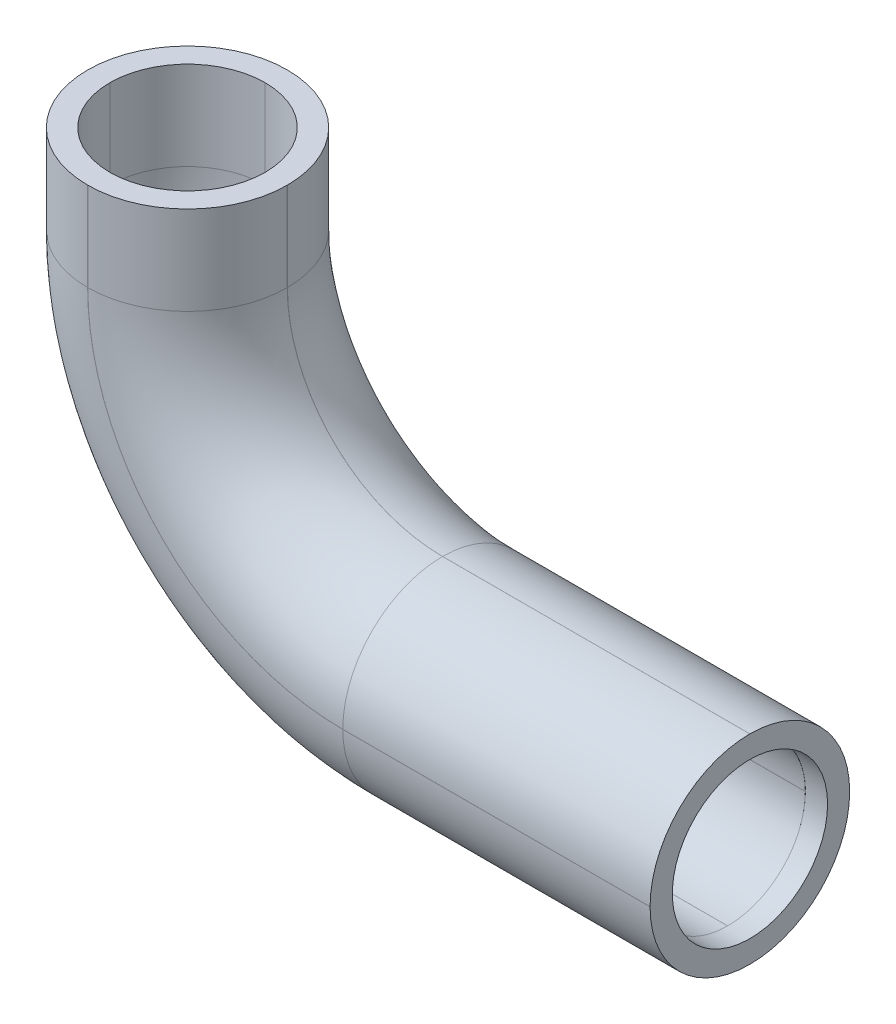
ISO-10303-21;
HEADER;
FILE_DESCRIPTION(('STEP AP214'),'2;1');
FILE_NAME('part.step','',(''),(''),'','','');
FILE_SCHEMA(('AUTOMOTIVE_DESIGN { 1 0 10303 214 1 1 1 1 }'));
ENDSEC;
DATA;
#1=APPLICATION_CONTEXT('core data for automotive mechanical design processes');
#2=APPLICATION_PROTOCOL_DEFINITION('international standard','automotive_design',2000,#1);
#3=PRODUCT_CONTEXT('',#1,'mechanical');
#4=PRODUCT('Part','Part','',(#3));
#5=PRODUCT_RELATED_PRODUCT_CATEGORY('part','',(#4));
#6=PRODUCT_DEFINITION_FORMATION('','',#4);
#7=PRODUCT_DEFINITION_CONTEXT('part definition',#1,'design');
#8=PRODUCT_DEFINITION('design','',#6,#7);
#9=PRODUCT_DEFINITION_SHAPE('','',#8);
#10=(LENGTH_UNIT() NAMED_UNIT(*) SI_UNIT(.MILLI.,.METRE.));
#11=(NAMED_UNIT(*) PLANE_ANGLE_UNIT() SI_UNIT($,.RADIAN.));
#12=(NAMED_UNIT(*) SI_UNIT($,.STERADIAN.) SOLID_ANGLE_UNIT());
#13=UNCERTAINTY_MEASURE_WITH_UNIT(LENGTH_MEASURE(1.E-05),#10,'distance_accuracy_value','');
#14=(GEOMETRIC_REPRESENTATION_CONTEXT(3) GLOBAL_UNCERTAINTY_ASSIGNED_CONTEXT((#13)) GLOBAL_UNIT_ASSIGNED_CONTEXT((#10,
#11,#12)) REPRESENTATION_CONTEXT('',''));
#15=CARTESIAN_POINT('',(0.,0.,0.));
#16=DIRECTION('',(0.,0.,1.));
#17=DIRECTION('',(1.,0.,0.));
#18=AXIS2_PLACEMENT_3D('',#15,#16,#17);
#19=CARTESIAN_POINT('',(0.,0.,-28.575));
#20=DIRECTION('',(-1.,0.,0.));
#21=DIRECTION('',(0.,0.,1.));
#22=AXIS2_PLACEMENT_3D('',#19,#20,#21);
#23=PLANE('',#22);
#24=DIRECTION('',(0.,0.,1.));
#25=VECTOR('',#24,1.);
#26=CARTESIAN_POINT('',(0.,63.5,-28.575));
#27=LINE('',#26,#25);
#28=CARTESIAN_POINT('',(0.,63.5,-14.3002));
#29=VERTEX_POINT('',#28);
#30=CARTESIAN_POINT('',(0.,63.5,-14.2748));
#31=VERTEX_POINT('',#30);
#32=EDGE_CURVE('E397',#29,#31,#27,.T.);
#33=ORIENTED_EDGE('',*,*,#32,.F.);
#34=DIRECTION('',(0.,-1.,0.));
#35=VECTOR('',#34,1.);
#36=CARTESIAN_POINT('',(0.,0.,-14.3002));
#37=LINE('',#36,#35);
#38=CARTESIAN_POINT('',(0.,50.8,-14.3002));
#39=VERTEX_POINT('',#38);
#40=EDGE_CURVE('E447',#29,#39,#37,.T.);
#41=ORIENTED_EDGE('',*,*,#40,.T.);
#42=DIRECTION('',(0.,0.,1.));
#43=VECTOR('',#42,1.);
#44=CARTESIAN_POINT('',(0.,50.8,-28.575));
#45=LINE('',#44,#43);
#46=CARTESIAN_POINT('',(0.,50.8,-14.2748));
#47=VERTEX_POINT('',#46);
#48=EDGE_CURVE('E414',#39,#47,#45,.T.);
#49=ORIENTED_EDGE('',*,*,#48,.T.);
#50=DIRECTION('',(0.,-1.,0.));
#51=VECTOR('',#50,1.);
#52=CARTESIAN_POINT('',(0.,63.5,-14.2748));
#53=LINE('',#52,#51);
#54=EDGE_CURVE('E445',#47,#31,#53,.F.);
#55=ORIENTED_EDGE('',*,*,#54,.T.);
#56=EDGE_LOOP('',(#33,#41,#49,#55));
#57=FACE_BOUND('',#56,.T.);
#58=ADVANCED_FACE('F35',(#57),#23,.T.);
#59=CARTESIAN_POINT('',(0.,63.5,-28.575));
#60=DIRECTION('',(0.,1.,0.));
#61=DIRECTION('',(0.,0.,1.));
#62=AXIS2_PLACEMENT_3D('',#59,#60,#61);
#63=PLANE('',#62);
#64=DIRECTION('',(-1.,0.,0.));
#65=VECTOR('',#64,1.);
#66=CARTESIAN_POINT('',(0.,63.5,-25.4));
#67=LINE('',#66,#65);
#68=CARTESIAN_POINT('',(14.3002,63.5,-25.4));
#69=VERTEX_POINT('',#68);
#70=CARTESIAN_POINT('',(14.2748,63.5,-25.4));
#71=VERTEX_POINT('',#70);
#72=EDGE_CURVE('E378',#69,#71,#67,.T.);
#73=ORIENTED_EDGE('',*,*,#72,.F.);
#74=CARTESIAN_POINT('',(14.3002,63.5,-14.3002));
#75=DIRECTION('',(0.,1.,0.));
#76=DIRECTION('',(0.,0.,1.));
#77=AXIS2_PLACEMENT_3D('',#74,#75,#76);
#78=CIRCLE('',#77,11.0998);
#79=CARTESIAN_POINT('',(25.4,63.5,-14.3002));
#80=VERTEX_POINT('',#79);
#81=EDGE_CURVE('E369',#80,#69,#78,.T.);
#82=ORIENTED_EDGE('',*,*,#81,.F.);
#83=DIRECTION('',(0.,0.,1.));
#84=VECTOR('',#83,1.);
#85=CARTESIAN_POINT('',(25.4,63.5,-28.575));
#86=LINE('',#85,#84);
#87=CARTESIAN_POINT('',(25.4,63.5,-14.2748));
#88=VERTEX_POINT('',#87);
#89=EDGE_CURVE('E59',#80,#88,#86,.T.);
#90=ORIENTED_EDGE('',*,*,#89,.T.);
#91=CARTESIAN_POINT('',(14.3002,63.5,-14.2748));
#92=DIRECTION('',(0.,1.,0.));
#93=DIRECTION('',(0.,0.,1.));
#94=AXIS2_PLACEMENT_3D('',#91,#92,#93);
#95=CIRCLE('',#94,11.0998);
#96=CARTESIAN_POINT('',(14.3002,63.5,-3.175));
#97=VERTEX_POINT('',#96);
#98=EDGE_CURVE('E373',#97,#88,#95,.T.);
#99=ORIENTED_EDGE('',*,*,#98,.F.);
#100=DIRECTION('',(-1.,0.,0.));
#101=VECTOR('',#100,1.);
#102=CARTESIAN_POINT('',(0.,63.5,-3.175));
#103=LINE('',#102,#101);
#104=CARTESIAN_POINT('',(14.2748,63.5,-3.175));
#105=VERTEX_POINT('',#104);
#106=EDGE_CURVE('E291',#97,#105,#103,.T.);
#107=ORIENTED_EDGE('',*,*,#106,.T.);
#108=CARTESIAN_POINT('',(14.2748,63.5,-14.2748));
#109=DIRECTION('',(0.,1.,0.));
#110=DIRECTION('',(0.,0.,1.));
#111=AXIS2_PLACEMENT_3D('',#108,#109,#110);
#112=CIRCLE('',#111,11.0998);
#113=CARTESIAN_POINT('',(3.175,63.5,-14.2748));
#114=VERTEX_POINT('',#113);
#115=EDGE_CURVE('E367',#114,#105,#112,.T.);
#116=ORIENTED_EDGE('',*,*,#115,.F.);
#117=DIRECTION('',(0.,0.,1.));
#118=VECTOR('',#117,1.);
#119=CARTESIAN_POINT('',(3.175,63.5,-28.575));
#120=LINE('',#119,#118);
#121=CARTESIAN_POINT('',(3.175,63.5,-14.3002));
#122=VERTEX_POINT('',#121);
#123=EDGE_CURVE('E301',#122,#114,#120,.T.);
#124=ORIENTED_EDGE('',*,*,#123,.F.);
#125=CARTESIAN_POINT('',(14.2748,63.5,-14.3002));
#126=DIRECTION('',(0.,1.,0.));
#127=DIRECTION('',(0.,0.,1.));
#128=AXIS2_PLACEMENT_3D('',#125,#126,#127);
#129=CIRCLE('',#128,11.0998);
#130=EDGE_CURVE('E360',#71,#122,#129,.T.);
#131=ORIENTED_EDGE('',*,*,#130,.F.);
#132=EDGE_LOOP('',(#73,#82,#90,#99,#107,#116,#124,#131));
#133=FACE_BOUND('',#132,.T.);
#134=DIRECTION('',(-1.,0.,0.));
#135=VECTOR('',#134,1.);
#136=CARTESIAN_POINT('',(0.,63.5,-28.575));
#137=LINE('',#136,#135);
#138=CARTESIAN_POINT('',(14.3002,63.5,-28.575));
#139=VERTEX_POINT('',#138);
#140=CARTESIAN_POINT('',(14.2748,63.5,-28.575));
#141=VERTEX_POINT('',#140);
#142=EDGE_CURVE('E386',#139,#141,#137,.T.);
#143=ORIENTED_EDGE('',*,*,#142,.T.);
#144=CARTESIAN_POINT('',(14.2748,63.5,-14.3002));
#145=DIRECTION('',(0.,1.,0.));
#146=DIRECTION('',(0.,0.,1.));
#147=AXIS2_PLACEMENT_3D('',#144,#145,#146);
#148=CIRCLE('',#147,14.2748);
#149=EDGE_CURVE('E455',#141,#29,#148,.T.);
#150=ORIENTED_EDGE('',*,*,#149,.T.);
#151=ORIENTED_EDGE('',*,*,#32,.T.);
#152=CARTESIAN_POINT('',(14.2748,63.5,-14.2748));
#153=DIRECTION('',(0.,1.,0.));
#154=DIRECTION('',(0.,0.,1.));
#155=AXIS2_PLACEMENT_3D('',#152,#153,#154);
#156=CIRCLE('',#155,14.2748);
#157=CARTESIAN_POINT('',(14.2748,63.5,0.));
#158=VERTEX_POINT('',#157);
#159=EDGE_CURVE('E453',#31,#158,#156,.T.);
#160=ORIENTED_EDGE('',*,*,#159,.T.);
#161=DIRECTION('',(-1.,0.,0.));
#162=VECTOR('',#161,1.);
#163=CARTESIAN_POINT('',(0.,63.5,0.));
#164=LINE('',#163,#162);
#165=CARTESIAN_POINT('',(14.3002,63.5,0.));
#166=VERTEX_POINT('',#165);
#167=EDGE_CURVE('E387',#166,#158,#164,.T.);
#168=ORIENTED_EDGE('',*,*,#167,.F.);
#169=CARTESIAN_POINT('',(14.3002,63.5,-14.2748));
#170=DIRECTION('',(0.,1.,0.));
#171=DIRECTION('',(0.,0.,1.));
#172=AXIS2_PLACEMENT_3D('',#169,#170,#171);
#173=CIRCLE('',#172,14.2748);
#174=CARTESIAN_POINT('',(28.575,63.5,-14.2748));
#175=VERTEX_POINT('',#174);
#176=EDGE_CURVE('E449',#166,#175,#173,.T.);
#177=ORIENTED_EDGE('',*,*,#176,.T.);
#178=DIRECTION('',(0.,0.,1.));
#179=VECTOR('',#178,1.);
#180=CARTESIAN_POINT('',(28.575,63.5,-28.575));
#181=LINE('',#180,#179);
#182=CARTESIAN_POINT('',(28.575,63.5,-14.3002));
#183=VERTEX_POINT('',#182);
#184=EDGE_CURVE('E401',#183,#175,#181,.T.);
#185=ORIENTED_EDGE('',*,*,#184,.F.);
#186=CARTESIAN_POINT('',(14.3002,63.5,-14.3002));
#187=DIRECTION('',(0.,1.,0.));
#188=DIRECTION('',(0.,0.,1.));
#189=AXIS2_PLACEMENT_3D('',#186,#187,#188);
#190=CIRCLE('',#189,14.2748);
#191=EDGE_CURVE('E451',#183,#139,#190,.T.);
#192=ORIENTED_EDGE('',*,*,#191,.T.);
#193=EDGE_LOOP('',(#143,#150,#151,#160,#168,#177,#185,#192));
#194=FACE_BOUND('',#193,.T.);
#195=ADVANCED_FACE('F519',(#133,#194),#63,.T.);
#196=CARTESIAN_POINT('',(28.575,63.5,-28.575));
#197=DIRECTION('',(1.,0.,0.));
#198=DIRECTION('',(0.,0.,-1.));
#199=AXIS2_PLACEMENT_3D('',#196,#197,#198);
#200=PLANE('',#199);
#201=DIRECTION('',(0.,0.,1.));
#202=VECTOR('',#201,1.);
#203=CARTESIAN_POINT('',(28.575,50.8,-28.575));
#204=LINE('',#203,#202);
#205=CARTESIAN_POINT('',(28.575,50.8,-14.2748));
#206=VERTEX_POINT('',#205);
#207=CARTESIAN_POINT('',(28.575,50.8,-14.3002));
#208=VERTEX_POINT('',#207);
#209=EDGE_CURVE('E411',#206,#208,#204,.F.);
#210=ORIENTED_EDGE('',*,*,#209,.T.);
#211=DIRECTION('',(0.,1.,0.));
#212=VECTOR('',#211,1.);
#213=CARTESIAN_POINT('',(28.575,63.5,-14.3002));
#214=LINE('',#213,#212);
#215=EDGE_CURVE('E473',#208,#183,#214,.T.);
#216=ORIENTED_EDGE('',*,*,#215,.T.);
#217=ORIENTED_EDGE('',*,*,#184,.T.);
#218=DIRECTION('',(0.,1.,0.));
#219=VECTOR('',#218,1.);
#220=CARTESIAN_POINT('',(28.575,50.8,-14.2748));
#221=LINE('',#220,#219);
#222=EDGE_CURVE('E471',#175,#206,#221,.F.);
#223=ORIENTED_EDGE('',*,*,#222,.T.);
#224=EDGE_LOOP('',(#210,#216,#217,#223));
#225=FACE_BOUND('',#224,.T.);
#226=ADVANCED_FACE('F579',(#225),#200,.T.);
#227=CARTESIAN_POINT('',(28.575,28.575,-28.575));
#228=DIRECTION('',(0.,1.,0.));
#229=DIRECTION('',(0.,0.,1.));
#230=AXIS2_PLACEMENT_3D('',#227,#228,#229);
#231=PLANE('',#230);
#232=DIRECTION('',(0.,0.,1.));
#233=VECTOR('',#232,1.);
#234=CARTESIAN_POINT('',(94.7928,28.575,-28.575));
#235=LINE('',#234,#233);
#236=CARTESIAN_POINT('',(94.7928,28.575,-14.3002));
#237=VERTEX_POINT('',#236);
#238=CARTESIAN_POINT('',(94.7928,28.575,-14.2748));
#239=VERTEX_POINT('',#238);
#240=EDGE_CURVE('E404',#237,#239,#235,.T.);
#241=ORIENTED_EDGE('',*,*,#240,.F.);
#242=DIRECTION('',(-1.,0.,0.));
#243=VECTOR('',#242,1.);
#244=CARTESIAN_POINT('',(28.575,28.575,-14.3002));
#245=LINE('',#244,#243);
#246=CARTESIAN_POINT('',(50.8,28.575,-14.3002));
#247=VERTEX_POINT('',#246);
#248=EDGE_CURVE('E478',#237,#247,#245,.T.);
#249=ORIENTED_EDGE('',*,*,#248,.T.);
#250=DIRECTION('',(0.,0.,1.));
#251=VECTOR('',#250,1.);
#252=CARTESIAN_POINT('',(50.8,28.575,0.));
#253=LINE('',#252,#251);
#254=CARTESIAN_POINT('',(50.8,28.575,-14.2748));
#255=VERTEX_POINT('',#254);
#256=EDGE_CURVE('E400',#247,#255,#253,.T.);
#257=ORIENTED_EDGE('',*,*,#256,.T.);
#258=DIRECTION('',(-1.,0.,0.));
#259=VECTOR('',#258,1.);
#260=CARTESIAN_POINT('',(94.7928,28.575,-14.2748));
#261=LINE('',#260,#259);
#262=EDGE_CURVE('E476',#255,#239,#261,.F.);
#263=ORIENTED_EDGE('',*,*,#262,.T.);
#264=EDGE_LOOP('',(#241,#249,#257,#263));
#265=FACE_BOUND('',#264,.T.);
#266=ADVANCED_FACE('F565',(#265),#231,.T.);
#267=CARTESIAN_POINT('',(94.7928,0.,-28.575));
#268=DIRECTION('',(1.,0.,0.));
#269=DIRECTION('',(0.,0.,-1.));
#270=AXIS2_PLACEMENT_3D('',#267,#268,#269);
#271=PLANE('',#270);
#272=CARTESIAN_POINT('',(94.7928,14.3002,-14.3002));
#273=DIRECTION('',(1.,0.,0.));
#274=DIRECTION('',(0.,0.,-1.));
#275=AXIS2_PLACEMENT_3D('',#272,#273,#274);
#276=CIRCLE('',#275,11.1125);
#277=CARTESIAN_POINT('',(94.7928,14.3002,-25.4127));
#278=VERTEX_POINT('',#277);
#279=EDGE_CURVE('E259',#278,#278,#276,.T.);
#280=ORIENTED_EDGE('',*,*,#279,.F.);
#281=EDGE_LOOP('',(#280));
#282=FACE_BOUND('',#281,.T.);
#283=DIRECTION('',(0.,0.,1.));
#284=VECTOR('',#283,1.);
#285=CARTESIAN_POINT('',(94.7928,0.,-28.575));
#286=LINE('',#285,#284);
#287=CARTESIAN_POINT('',(94.7928,0.,-14.3002));
#288=VERTEX_POINT('',#287);
#289=CARTESIAN_POINT('',(94.7928,0.,-14.2748));
#290=VERTEX_POINT('',#289);
#291=EDGE_CURVE('E390',#288,#290,#286,.T.);
#292=ORIENTED_EDGE('',*,*,#291,.F.);
#293=CARTESIAN_POINT('',(94.7928,14.2748,-14.3002));
#294=DIRECTION('',(1.,0.,0.));
#295=DIRECTION('',(0.,0.,-1.));
#296=AXIS2_PLACEMENT_3D('',#293,#294,#295);
#297=CIRCLE('',#296,14.2748);
#298=CARTESIAN_POINT('',(94.7928,14.2748,-28.575));
#299=VERTEX_POINT('',#298);
#300=EDGE_CURVE('E431',#288,#299,#297,.T.);
#301=ORIENTED_EDGE('',*,*,#300,.T.);
#302=DIRECTION('',(0.,1.,0.));
#303=VECTOR('',#302,1.);
#304=CARTESIAN_POINT('',(94.7928,0.,-28.575));
#305=LINE('',#304,#303);
#306=CARTESIAN_POINT('',(94.7928,14.3002,-28.575));
#307=VERTEX_POINT('',#306);
#308=EDGE_CURVE('E383',#299,#307,#305,.T.);
#309=ORIENTED_EDGE('',*,*,#308,.T.);
#310=CARTESIAN_POINT('',(94.7928,14.3002,-14.3002));
#311=DIRECTION('',(1.,0.,0.));
#312=DIRECTION('',(0.,0.,-1.));
#313=AXIS2_PLACEMENT_3D('',#310,#311,#312);
#314=CIRCLE('',#313,14.2748);
#315=EDGE_CURVE('E427',#307,#237,#314,.T.);
#316=ORIENTED_EDGE('',*,*,#315,.T.);
#317=ORIENTED_EDGE('',*,*,#240,.T.);
#318=CARTESIAN_POINT('',(94.7928,14.3002,-14.2748));
#319=DIRECTION('',(1.,0.,0.));
#320=DIRECTION('',(0.,0.,-1.));
#321=AXIS2_PLACEMENT_3D('',#318,#319,#320);
#322=CIRCLE('',#321,14.2748);
#323=CARTESIAN_POINT('',(94.7928,14.3002,0.));
#324=VERTEX_POINT('',#323);
#325=EDGE_CURVE('E425',#239,#324,#322,.T.);
#326=ORIENTED_EDGE('',*,*,#325,.T.);
#327=DIRECTION('',(0.,1.,0.));
#328=VECTOR('',#327,1.);
#329=CARTESIAN_POINT('',(94.7928,0.,0.));
#330=LINE('',#329,#328);
#331=CARTESIAN_POINT('',(94.7928,14.2748,0.));
#332=VERTEX_POINT('',#331);
#333=EDGE_CURVE('E391',#332,#324,#330,.T.);
#334=ORIENTED_EDGE('',*,*,#333,.F.);
#335=CARTESIAN_POINT('',(94.7928,14.2748,-14.2748));
#336=DIRECTION('',(1.,0.,0.));
#337=DIRECTION('',(0.,0.,-1.));
#338=AXIS2_PLACEMENT_3D('',#335,#336,#337);
#339=CIRCLE('',#338,14.2748);
#340=EDGE_CURVE('E429',#332,#290,#339,.T.);
#341=ORIENTED_EDGE('',*,*,#340,.T.);
#342=EDGE_LOOP('',(#292,#301,#309,#316,#317,#326,#334,#341));
#343=FACE_BOUND('',#342,.T.);
#344=ADVANCED_FACE('F559',(#282,#343),#271,.T.);
#345=CARTESIAN_POINT('',(0.,0.,-28.575));
#346=DIRECTION('',(0.,-1.,0.));
#347=DIRECTION('',(0.,0.,-1.));
#348=AXIS2_PLACEMENT_3D('',#345,#346,#347);
#349=PLANE('',#348);
#350=DIRECTION('',(0.,0.,1.));
#351=VECTOR('',#350,1.);
#352=CARTESIAN_POINT('',(50.8,0.,-28.575));
#353=LINE('',#352,#351);
#354=CARTESIAN_POINT('',(50.8,0.,-14.2748));
#355=VERTEX_POINT('',#354);
#356=CARTESIAN_POINT('',(50.8,0.,-14.3002));
#357=VERTEX_POINT('',#356);
#358=EDGE_CURVE('E417',#355,#357,#353,.F.);
#359=ORIENTED_EDGE('',*,*,#358,.T.);
#360=DIRECTION('',(1.,0.,0.));
#361=VECTOR('',#360,1.);
#362=CARTESIAN_POINT('',(0.,0.,-14.3002));
#363=LINE('',#362,#361);
#364=EDGE_CURVE('E422',#357,#288,#363,.T.);
#365=ORIENTED_EDGE('',*,*,#364,.T.);
#366=ORIENTED_EDGE('',*,*,#291,.T.);
#367=DIRECTION('',(1.,0.,0.));
#368=VECTOR('',#367,1.);
#369=CARTESIAN_POINT('',(50.8,0.,-14.2748));
#370=LINE('',#369,#368);
#371=EDGE_CURVE('E420',#290,#355,#370,.F.);
#372=ORIENTED_EDGE('',*,*,#371,.T.);
#373=EDGE_LOOP('',(#359,#365,#366,#372));
#374=FACE_BOUND('',#373,.T.);
#375=ADVANCED_FACE('F556',(#374),#349,.T.);
#376=CARTESIAN_POINT('',(0.,0.,-28.575));
#377=DIRECTION('',(0.,0.,-1.));
#378=DIRECTION('',(-1.,0.,0.));
#379=AXIS2_PLACEMENT_3D('',#376,#377,#378);
#380=PLANE('',#379);
#381=ORIENTED_EDGE('',*,*,#308,.F.);
#382=DIRECTION('',(1.,0.,0.));
#383=VECTOR('',#382,1.);
#384=CARTESIAN_POINT('',(0.,14.2748,-28.575));
#385=LINE('',#384,#383);
#386=CARTESIAN_POINT('',(50.8,14.2748,-28.575));
#387=VERTEX_POINT('',#386);
#388=EDGE_CURVE('E443',#299,#387,#385,.F.);
#389=ORIENTED_EDGE('',*,*,#388,.T.);
#390=CARTESIAN_POINT('',(50.8,50.8,-28.575));
#391=DIRECTION('',(0.,0.,-1.));
#392=DIRECTION('',(-1.,0.,0.));
#393=AXIS2_PLACEMENT_3D('',#390,#391,#392);
#394=CIRCLE('',#393,36.5252);
#395=CARTESIAN_POINT('',(14.2748,50.8,-28.575));
#396=VERTEX_POINT('',#395);
#397=EDGE_CURVE('E439',#387,#396,#394,.T.);
#398=ORIENTED_EDGE('',*,*,#397,.T.);
#399=DIRECTION('',(0.,-1.,0.));
#400=VECTOR('',#399,1.);
#401=CARTESIAN_POINT('',(14.2748,0.,-28.575));
#402=LINE('',#401,#400);
#403=EDGE_CURVE('E441',#396,#141,#402,.F.);
#404=ORIENTED_EDGE('',*,*,#403,.T.);
#405=ORIENTED_EDGE('',*,*,#142,.F.);
#406=DIRECTION('',(0.,1.,0.));
#407=VECTOR('',#406,1.);
#408=CARTESIAN_POINT('',(14.3002,0.,-28.575));
#409=LINE('',#408,#407);
#410=CARTESIAN_POINT('',(14.3002,50.8,-28.575));
#411=VERTEX_POINT('',#410);
#412=EDGE_CURVE('E437',#139,#411,#409,.F.);
#413=ORIENTED_EDGE('',*,*,#412,.T.);
#414=CARTESIAN_POINT('',(50.8,50.8,-28.575));
#415=DIRECTION('',(0.,0.,-1.));
#416=DIRECTION('',(-1.,0.,0.));
#417=AXIS2_PLACEMENT_3D('',#414,#415,#416);
#418=CIRCLE('',#417,36.4998);
#419=CARTESIAN_POINT('',(50.8,14.3002,-28.575));
#420=VERTEX_POINT('',#419);
#421=EDGE_CURVE('E433',#411,#420,#418,.F.);
#422=ORIENTED_EDGE('',*,*,#421,.T.);
#423=DIRECTION('',(-1.,0.,0.));
#424=VECTOR('',#423,1.);
#425=CARTESIAN_POINT('',(0.,14.3002,-28.575));
#426=LINE('',#425,#424);
#427=EDGE_CURVE('E435',#420,#307,#426,.F.);
#428=ORIENTED_EDGE('',*,*,#427,.T.);
#429=EDGE_LOOP('',(#381,#389,#398,#404,#405,#413,#422,#428));
#430=FACE_BOUND('',#429,.T.);
#431=ADVANCED_FACE('F589',(#430),#380,.T.);
#432=CARTESIAN_POINT('',(0.,0.,0.));
#433=DIRECTION('',(0.,0.,-1.));
#434=DIRECTION('',(-1.,0.,0.));
#435=AXIS2_PLACEMENT_3D('',#432,#433,#434);
#436=PLANE('',#435);
#437=ORIENTED_EDGE('',*,*,#167,.T.);
#438=DIRECTION('',(0.,-1.,0.));
#439=VECTOR('',#438,1.);
#440=CARTESIAN_POINT('',(14.2748,50.8,0.));
#441=LINE('',#440,#439);
#442=CARTESIAN_POINT('',(14.2748,50.8,0.));
#443=VERTEX_POINT('',#442);
#444=EDGE_CURVE('E468',#158,#443,#441,.T.);
#445=ORIENTED_EDGE('',*,*,#444,.T.);
#446=CARTESIAN_POINT('',(50.8,50.8,0.));
#447=DIRECTION('',(0.,0.,-1.));
#448=DIRECTION('',(-1.,0.,0.));
#449=AXIS2_PLACEMENT_3D('',#446,#447,#448);
#450=CIRCLE('',#449,36.5252);
#451=CARTESIAN_POINT('',(50.8,14.2748,0.));
#452=VERTEX_POINT('',#451);
#453=EDGE_CURVE('E464',#443,#452,#450,.F.);
#454=ORIENTED_EDGE('',*,*,#453,.T.);
#455=DIRECTION('',(1.,0.,0.));
#456=VECTOR('',#455,1.);
#457=CARTESIAN_POINT('',(94.7928,14.2748,0.));
#458=LINE('',#457,#456);
#459=EDGE_CURVE('E466',#452,#332,#458,.T.);
#460=ORIENTED_EDGE('',*,*,#459,.T.);
#461=ORIENTED_EDGE('',*,*,#333,.T.);
#462=DIRECTION('',(-1.,0.,0.));
#463=VECTOR('',#462,1.);
#464=CARTESIAN_POINT('',(50.8,14.3002,0.));
#465=LINE('',#464,#463);
#466=CARTESIAN_POINT('',(50.8,14.3002,0.));
#467=VERTEX_POINT('',#466);
#468=EDGE_CURVE('E461',#324,#467,#465,.T.);
#469=ORIENTED_EDGE('',*,*,#468,.T.);
#470=CARTESIAN_POINT('',(50.8,50.8,0.));
#471=DIRECTION('',(0.,0.,-1.));
#472=DIRECTION('',(-1.,0.,0.));
#473=AXIS2_PLACEMENT_3D('',#470,#471,#472);
#474=CIRCLE('',#473,36.4998);
#475=CARTESIAN_POINT('',(14.3002,50.8,0.));
#476=VERTEX_POINT('',#475);
#477=EDGE_CURVE('E457',#467,#476,#474,.T.);
#478=ORIENTED_EDGE('',*,*,#477,.T.);
#479=DIRECTION('',(0.,1.,0.));
#480=VECTOR('',#479,1.);
#481=CARTESIAN_POINT('',(14.3002,63.5,0.));
#482=LINE('',#481,#480);
#483=EDGE_CURVE('E459',#476,#166,#482,.T.);
#484=ORIENTED_EDGE('',*,*,#483,.T.);
#485=EDGE_LOOP('',(#437,#445,#454,#460,#461,#469,#478,#484));
#486=FACE_BOUND('',#485,.T.);
#487=ADVANCED_FACE('F516',(#486),#436,.F.);
#488=CARTESIAN_POINT('',(50.8,50.8,-28.575));
#489=DIRECTION('',(0.,0.,-1.));
#490=DIRECTION('',(-1.,0.,0.));
#491=AXIS2_PLACEMENT_3D('',#488,#489,#490);
#492=CYLINDRICAL_SURFACE('',#491,22.225);
#493=ORIENTED_EDGE('',*,*,#256,.F.);
#494=CARTESIAN_POINT('',(50.8,50.8,-14.3002));
#495=DIRECTION('',(0.,0.,-1.));
#496=DIRECTION('',(-1.,0.,0.));
#497=AXIS2_PLACEMENT_3D('',#494,#495,#496);
#498=CIRCLE('',#497,22.225);
#499=EDGE_CURVE('E11',#247,#208,#498,.T.);
#500=ORIENTED_EDGE('',*,*,#499,.T.);
#501=ORIENTED_EDGE('',*,*,#209,.F.);
#502=CARTESIAN_POINT('',(50.8,50.8,-14.2748));
#503=DIRECTION('',(0.,0.,-1.));
#504=DIRECTION('',(-1.,0.,0.));
#505=AXIS2_PLACEMENT_3D('',#502,#503,#504);
#506=CIRCLE('',#505,22.225);
#507=EDGE_CURVE('E44',#206,#255,#506,.F.);
#508=ORIENTED_EDGE('',*,*,#507,.T.);
#509=EDGE_LOOP('',(#493,#500,#501,#508));
#510=FACE_BOUND('',#509,.T.);
#511=ADVANCED_FACE('F575',(#510),#492,.F.);
#512=CARTESIAN_POINT('',(50.8,50.8,-28.575));
#513=DIRECTION('',(0.,0.,1.));
#514=DIRECTION('',(1.,0.,0.));
#515=AXIS2_PLACEMENT_3D('',#512,#513,#514);
#516=CYLINDRICAL_SURFACE('',#515,50.8);
#517=ORIENTED_EDGE('',*,*,#48,.F.);
#518=CARTESIAN_POINT('',(50.8,50.8,-14.3002));
#519=DIRECTION('',(0.,0.,-1.));
#520=DIRECTION('',(-1.,0.,0.));
#521=AXIS2_PLACEMENT_3D('',#518,#519,#520);
#522=CIRCLE('',#521,50.8);
#523=EDGE_CURVE('E482',#39,#357,#522,.F.);
#524=ORIENTED_EDGE('',*,*,#523,.T.);
#525=ORIENTED_EDGE('',*,*,#358,.F.);
#526=CARTESIAN_POINT('',(50.8,50.8,-14.2748));
#527=DIRECTION('',(0.,0.,-1.));
#528=DIRECTION('',(-1.,0.,0.));
#529=AXIS2_PLACEMENT_3D('',#526,#527,#528);
#530=CIRCLE('',#529,50.8);
#531=EDGE_CURVE('E480',#355,#47,#530,.T.);
#532=ORIENTED_EDGE('',*,*,#531,.T.);
#533=EDGE_LOOP('',(#517,#524,#525,#532));
#534=FACE_BOUND('',#533,.T.);
#535=ADVANCED_FACE('F541',(#534),#516,.T.);
#536=CARTESIAN_POINT('',(14.2748,0.,-14.3002));
#537=DIRECTION('',(0.,-1.,0.));
#538=DIRECTION('',(0.,0.,-1.));
#539=AXIS2_PLACEMENT_3D('',#536,#537,#538);
#540=CYLINDRICAL_SURFACE('',#539,14.2748);
#541=ORIENTED_EDGE('',*,*,#149,.F.);
#542=ORIENTED_EDGE('',*,*,#403,.F.);
#543=CARTESIAN_POINT('',(14.2748,50.8,-14.3002));
#544=DIRECTION('',(0.,-1.,0.));
#545=DIRECTION('',(0.,0.,-1.));
#546=AXIS2_PLACEMENT_3D('',#543,#544,#545);
#547=CIRCLE('',#546,14.2748);
#548=EDGE_CURVE('E394',#39,#396,#547,.T.);
#549=ORIENTED_EDGE('',*,*,#548,.F.);
#550=ORIENTED_EDGE('',*,*,#40,.F.);
#551=EDGE_LOOP('',(#541,#542,#549,#550));
#552=FACE_BOUND('',#551,.T.);
#553=ADVANCED_FACE('F547',(#552),#540,.T.);
#554=CARTESIAN_POINT('',(50.8,50.8,-14.3002));
#555=DIRECTION('',(0.,0.,-1.));
#556=DIRECTION('',(-1.,0.,0.));
#557=AXIS2_PLACEMENT_3D('',#554,#555,#556);
#558=TOROIDAL_SURFACE('',#557,36.5252,14.2748);
#559=ORIENTED_EDGE('',*,*,#548,.T.);
#560=ORIENTED_EDGE('',*,*,#397,.F.);
#561=CARTESIAN_POINT('',(50.8,14.2748,-14.3002));
#562=DIRECTION('',(1.,0.,0.));
#563=DIRECTION('',(0.,0.,-1.));
#564=AXIS2_PLACEMENT_3D('',#561,#562,#563);
#565=CIRCLE('',#564,14.2748);
#566=EDGE_CURVE('E485',#357,#387,#565,.T.);
#567=ORIENTED_EDGE('',*,*,#566,.F.);
#568=ORIENTED_EDGE('',*,*,#523,.F.);
#569=EDGE_LOOP('',(#559,#560,#567,#568));
#570=FACE_BOUND('',#569,.T.);
#571=ADVANCED_FACE('F553',(#570),#558,.T.);
#572=CARTESIAN_POINT('',(0.,14.2748,-14.3002));
#573=DIRECTION('',(1.,0.,0.));
#574=DIRECTION('',(0.,0.,-1.));
#575=AXIS2_PLACEMENT_3D('',#572,#573,#574);
#576=CYLINDRICAL_SURFACE('',#575,14.2748);
#577=ORIENTED_EDGE('',*,*,#566,.T.);
#578=ORIENTED_EDGE('',*,*,#388,.F.);
#579=ORIENTED_EDGE('',*,*,#300,.F.);
#580=ORIENTED_EDGE('',*,*,#364,.F.);
#581=EDGE_LOOP('',(#577,#578,#579,#580));
#582=FACE_BOUND('',#581,.T.);
#583=ADVANCED_FACE('F592',(#582),#576,.T.);
#584=CARTESIAN_POINT('',(0.,14.2748,-14.2748));
#585=DIRECTION('',(-1.,0.,0.));
#586=DIRECTION('',(0.,0.,1.));
#587=AXIS2_PLACEMENT_3D('',#584,#585,#586);
#588=CYLINDRICAL_SURFACE('',#587,14.2748);
#589=ORIENTED_EDGE('',*,*,#340,.F.);
#590=ORIENTED_EDGE('',*,*,#459,.F.);
#591=CARTESIAN_POINT('',(50.8,14.2748,-14.2748));
#592=DIRECTION('',(-1.,0.,0.));
#593=DIRECTION('',(0.,0.,1.));
#594=AXIS2_PLACEMENT_3D('',#591,#592,#593);
#595=CIRCLE('',#594,14.2748);
#596=EDGE_CURVE('E488',#355,#452,#595,.T.);
#597=ORIENTED_EDGE('',*,*,#596,.F.);
#598=ORIENTED_EDGE('',*,*,#371,.F.);
#599=EDGE_LOOP('',(#589,#590,#597,#598));
#600=FACE_BOUND('',#599,.T.);
#601=ADVANCED_FACE('F534',(#600),#588,.T.);
#602=CARTESIAN_POINT('',(50.8,50.8,-14.2748));
#603=DIRECTION('',(0.,0.,-1.));
#604=DIRECTION('',(-1.,0.,0.));
#605=AXIS2_PLACEMENT_3D('',#602,#603,#604);
#606=TOROIDAL_SURFACE('',#605,36.5252,14.2748);
#607=ORIENTED_EDGE('',*,*,#596,.T.);
#608=ORIENTED_EDGE('',*,*,#453,.F.);
#609=CARTESIAN_POINT('',(14.2748,50.8,-14.2748));
#610=DIRECTION('',(0.,1.,0.));
#611=DIRECTION('',(0.,0.,1.));
#612=AXIS2_PLACEMENT_3D('',#609,#610,#611);
#613=CIRCLE('',#612,14.2748);
#614=EDGE_CURVE('E491',#47,#443,#613,.T.);
#615=ORIENTED_EDGE('',*,*,#614,.F.);
#616=ORIENTED_EDGE('',*,*,#531,.F.);
#617=EDGE_LOOP('',(#607,#608,#615,#616));
#618=FACE_BOUND('',#617,.T.);
#619=ADVANCED_FACE('F537',(#618),#606,.T.);
#620=CARTESIAN_POINT('',(14.2748,0.,-14.2748));
#621=DIRECTION('',(0.,1.,0.));
#622=DIRECTION('',(0.,0.,1.));
#623=AXIS2_PLACEMENT_3D('',#620,#621,#622);
#624=CYLINDRICAL_SURFACE('',#623,14.2748);
#625=ORIENTED_EDGE('',*,*,#159,.F.);
#626=ORIENTED_EDGE('',*,*,#54,.F.);
#627=ORIENTED_EDGE('',*,*,#614,.T.);
#628=ORIENTED_EDGE('',*,*,#444,.F.);
#629=EDGE_LOOP('',(#625,#626,#627,#628));
#630=FACE_BOUND('',#629,.T.);
#631=ADVANCED_FACE('F525',(#630),#624,.T.);
#632=CARTESIAN_POINT('',(28.575,14.3002,-14.3002));
#633=DIRECTION('',(-1.,0.,0.));
#634=DIRECTION('',(0.,0.,1.));
#635=AXIS2_PLACEMENT_3D('',#632,#633,#634);
#636=CYLINDRICAL_SURFACE('',#635,14.2748);
#637=ORIENTED_EDGE('',*,*,#315,.F.);
#638=ORIENTED_EDGE('',*,*,#427,.F.);
#639=CARTESIAN_POINT('',(50.8,14.3002,-14.3002));
#640=DIRECTION('',(-1.,0.,0.));
#641=DIRECTION('',(0.,0.,1.));
#642=AXIS2_PLACEMENT_3D('',#639,#640,#641);
#643=CIRCLE('',#642,14.2748);
#644=EDGE_CURVE('E493',#247,#420,#643,.T.);
#645=ORIENTED_EDGE('',*,*,#644,.F.);
#646=ORIENTED_EDGE('',*,*,#248,.F.);
#647=EDGE_LOOP('',(#637,#638,#645,#646));
#648=FACE_BOUND('',#647,.T.);
#649=ADVANCED_FACE('F571',(#648),#636,.T.);
#650=CARTESIAN_POINT('',(50.8,50.8,-14.3002));
#651=DIRECTION('',(0.,0.,-1.));
#652=DIRECTION('',(-1.,0.,0.));
#653=AXIS2_PLACEMENT_3D('',#650,#651,#652);
#654=TOROIDAL_SURFACE('',#653,36.4998,14.2748);
#655=ORIENTED_EDGE('',*,*,#644,.T.);
#656=ORIENTED_EDGE('',*,*,#421,.F.);
#657=CARTESIAN_POINT('',(14.3002,50.8,-14.3002));
#658=DIRECTION('',(0.,1.,0.));
#659=DIRECTION('',(0.,0.,1.));
#660=AXIS2_PLACEMENT_3D('',#657,#658,#659);
#661=CIRCLE('',#660,14.2748);
#662=EDGE_CURVE('E496',#208,#411,#661,.T.);
#663=ORIENTED_EDGE('',*,*,#662,.F.);
#664=ORIENTED_EDGE('',*,*,#499,.F.);
#665=EDGE_LOOP('',(#655,#656,#663,#664));
#666=FACE_BOUND('',#665,.T.);
#667=ADVANCED_FACE('F583',(#666),#654,.T.);
#668=CARTESIAN_POINT('',(14.3002,63.5,-14.3002));
#669=DIRECTION('',(0.,1.,0.));
#670=DIRECTION('',(0.,0.,1.));
#671=AXIS2_PLACEMENT_3D('',#668,#669,#670);
#672=CYLINDRICAL_SURFACE('',#671,14.2748);
#673=ORIENTED_EDGE('',*,*,#662,.T.);
#674=ORIENTED_EDGE('',*,*,#412,.F.);
#675=ORIENTED_EDGE('',*,*,#191,.F.);
#676=ORIENTED_EDGE('',*,*,#215,.F.);
#677=EDGE_LOOP('',(#673,#674,#675,#676));
#678=FACE_BOUND('',#677,.T.);
#679=ADVANCED_FACE('F586',(#678),#672,.T.);
#680=CARTESIAN_POINT('',(14.3002,0.,-14.2748));
#681=DIRECTION('',(0.,-1.,0.));
#682=DIRECTION('',(0.,0.,-1.));
#683=AXIS2_PLACEMENT_3D('',#680,#681,#682);
#684=CYLINDRICAL_SURFACE('',#683,14.2748);
#685=ORIENTED_EDGE('',*,*,#176,.F.);
#686=ORIENTED_EDGE('',*,*,#483,.F.);
#687=CARTESIAN_POINT('',(14.3002,50.8,-14.2748));
#688=DIRECTION('',(0.,-1.,0.));
#689=DIRECTION('',(0.,0.,-1.));
#690=AXIS2_PLACEMENT_3D('',#687,#688,#689);
#691=CIRCLE('',#690,14.2748);
#692=EDGE_CURVE('E39',#206,#476,#691,.T.);
#693=ORIENTED_EDGE('',*,*,#692,.F.);
#694=ORIENTED_EDGE('',*,*,#222,.F.);
#695=EDGE_LOOP('',(#685,#686,#693,#694));
#696=FACE_BOUND('',#695,.T.);
#697=ADVANCED_FACE('F37',(#696),#684,.T.);
#698=CARTESIAN_POINT('',(50.8,50.8,-14.2748));
#699=DIRECTION('',(0.,0.,-1.));
#700=DIRECTION('',(-1.,0.,0.));
#701=AXIS2_PLACEMENT_3D('',#698,#699,#700);
#702=TOROIDAL_SURFACE('',#701,36.4998,14.2748);
#703=ORIENTED_EDGE('',*,*,#692,.T.);
#704=ORIENTED_EDGE('',*,*,#477,.F.);
#705=CARTESIAN_POINT('',(50.8,14.3002,-14.2748));
#706=DIRECTION('',(1.,0.,0.));
#707=DIRECTION('',(0.,0.,-1.));
#708=AXIS2_PLACEMENT_3D('',#705,#706,#707);
#709=CIRCLE('',#708,14.2748);
#710=EDGE_CURVE('E306',#255,#467,#709,.T.);
#711=ORIENTED_EDGE('',*,*,#710,.F.);
#712=ORIENTED_EDGE('',*,*,#507,.F.);
#713=EDGE_LOOP('',(#703,#704,#711,#712));
#714=FACE_BOUND('',#713,.T.);
#715=ADVANCED_FACE('F509',(#714),#702,.T.);
#716=CARTESIAN_POINT('',(0.,14.3002,-14.2748));
#717=DIRECTION('',(1.,0.,0.));
#718=DIRECTION('',(0.,0.,-1.));
#719=AXIS2_PLACEMENT_3D('',#716,#717,#718);
#720=CYLINDRICAL_SURFACE('',#719,14.2748);
#721=ORIENTED_EDGE('',*,*,#325,.F.);
#722=ORIENTED_EDGE('',*,*,#262,.F.);
#723=ORIENTED_EDGE('',*,*,#710,.T.);
#724=ORIENTED_EDGE('',*,*,#468,.F.);
#725=EDGE_LOOP('',(#721,#722,#723,#724));
#726=FACE_BOUND('',#725,.T.);
#727=ADVANCED_FACE('F562',(#726),#720,.T.);
#728=CARTESIAN_POINT('',(3.175,0.,-28.575));
#729=DIRECTION('',(-1.,0.,0.));
#730=DIRECTION('',(0.,0.,1.));
#731=AXIS2_PLACEMENT_3D('',#728,#729,#730);
#732=PLANE('',#731);
#733=ORIENTED_EDGE('',*,*,#123,.T.);
#734=DIRECTION('',(0.,1.,0.));
#735=VECTOR('',#734,1.);
#736=CARTESIAN_POINT('',(3.175,0.,-14.2748));
#737=LINE('',#736,#735);
#738=CARTESIAN_POINT('',(3.175,50.8,-14.2748));
#739=VERTEX_POINT('',#738);
#740=EDGE_CURVE('E331',#739,#114,#737,.T.);
#741=ORIENTED_EDGE('',*,*,#740,.F.);
#742=DIRECTION('',(0.,0.,1.));
#743=VECTOR('',#742,1.);
#744=CARTESIAN_POINT('',(3.175,50.8,-28.575));
#745=LINE('',#744,#743);
#746=CARTESIAN_POINT('',(3.175,50.8,-14.3002));
#747=VERTEX_POINT('',#746);
#748=EDGE_CURVE('E310',#747,#739,#745,.T.);
#749=ORIENTED_EDGE('',*,*,#748,.F.);
#750=DIRECTION('',(0.,1.,0.));
#751=VECTOR('',#750,1.);
#752=CARTESIAN_POINT('',(3.175,0.,-14.3002));
#753=LINE('',#752,#751);
#754=EDGE_CURVE('E375',#122,#747,#753,.F.);
#755=ORIENTED_EDGE('',*,*,#754,.F.);
#756=EDGE_LOOP('',(#733,#741,#749,#755));
#757=FACE_BOUND('',#756,.T.);
#758=ADVANCED_FACE('F632',(#757),#732,.F.);
#759=CARTESIAN_POINT('',(25.4,63.5,-28.575));
#760=DIRECTION('',(1.,0.,0.));
#761=DIRECTION('',(0.,0.,-1.));
#762=AXIS2_PLACEMENT_3D('',#759,#760,#761);
#763=PLANE('',#762);
#764=DIRECTION('',(0.,0.,-1.));
#765=VECTOR('',#764,1.);
#766=CARTESIAN_POINT('',(25.4,50.8,-28.575));
#767=LINE('',#766,#765);
#768=CARTESIAN_POINT('',(25.4,50.8,-14.2748));
#769=VERTEX_POINT('',#768);
#770=CARTESIAN_POINT('',(25.4,50.8,-14.3002));
#771=VERTEX_POINT('',#770);
#772=EDGE_CURVE('E300',#769,#771,#767,.T.);
#773=ORIENTED_EDGE('',*,*,#772,.F.);
#774=DIRECTION('',(0.,1.,0.));
#775=VECTOR('',#774,1.);
#776=CARTESIAN_POINT('',(25.4,63.5,-14.2748));
#777=LINE('',#776,#775);
#778=EDGE_CURVE('E314',#88,#769,#777,.F.);
#779=ORIENTED_EDGE('',*,*,#778,.F.);
#780=ORIENTED_EDGE('',*,*,#89,.F.);
#781=DIRECTION('',(0.,1.,0.));
#782=VECTOR('',#781,1.);
#783=CARTESIAN_POINT('',(25.4,63.5,-14.3002));
#784=LINE('',#783,#782);
#785=EDGE_CURVE('E303',#771,#80,#784,.T.);
#786=ORIENTED_EDGE('',*,*,#785,.F.);
#787=EDGE_LOOP('',(#773,#779,#780,#786));
#788=FACE_BOUND('',#787,.T.);
#789=ADVANCED_FACE('F751',(#788),#763,.F.);
#790=CARTESIAN_POINT('',(28.575,25.4,-28.575));
#791=DIRECTION('',(0.,1.,0.));
#792=DIRECTION('',(0.,0.,1.));
#793=AXIS2_PLACEMENT_3D('',#790,#791,#792);
#794=PLANE('',#793);
#795=DIRECTION('',(0.,0.,1.));
#796=VECTOR('',#795,1.);
#797=CARTESIAN_POINT('',(91.6178,25.4,-28.575));
#798=LINE('',#797,#796);
#799=CARTESIAN_POINT('',(91.6178,25.4,-14.3002));
#800=VERTEX_POINT('',#799);
#801=CARTESIAN_POINT('',(91.6178,25.4,-14.2748));
#802=VERTEX_POINT('',#801);
#803=EDGE_CURVE('E289',#800,#802,#798,.T.);
#804=ORIENTED_EDGE('',*,*,#803,.T.);
#805=DIRECTION('',(1.,0.,0.));
#806=VECTOR('',#805,1.);
#807=CARTESIAN_POINT('',(28.575,25.4,-14.2748));
#808=LINE('',#807,#806);
#809=CARTESIAN_POINT('',(50.8,25.4,-14.2748));
#810=VERTEX_POINT('',#809);
#811=EDGE_CURVE('E281',#810,#802,#808,.T.);
#812=ORIENTED_EDGE('',*,*,#811,.F.);
#813=DIRECTION('',(0.,0.,1.));
#814=VECTOR('',#813,1.);
#815=CARTESIAN_POINT('',(50.8,25.4,-28.575));
#816=LINE('',#815,#814);
#817=CARTESIAN_POINT('',(50.8,25.4,-14.3002));
#818=VERTEX_POINT('',#817);
#819=EDGE_CURVE('E297',#818,#810,#816,.T.);
#820=ORIENTED_EDGE('',*,*,#819,.F.);
#821=DIRECTION('',(1.,0.,0.));
#822=VECTOR('',#821,1.);
#823=CARTESIAN_POINT('',(28.575,25.4,-14.3002));
#824=LINE('',#823,#822);
#825=EDGE_CURVE('E294',#800,#818,#824,.F.);
#826=ORIENTED_EDGE('',*,*,#825,.F.);
#827=EDGE_LOOP('',(#804,#812,#820,#826));
#828=FACE_BOUND('',#827,.T.);
#829=ADVANCED_FACE('F761',(#828),#794,.F.);
#830=CARTESIAN_POINT('',(91.6178,0.,-28.575));
#831=DIRECTION('',(1.,0.,0.));
#832=DIRECTION('',(0.,0.,-1.));
#833=AXIS2_PLACEMENT_3D('',#830,#831,#832);
#834=PLANE('',#833);
#835=CARTESIAN_POINT('',(91.6178,14.3002,-14.2748));
#836=DIRECTION('',(1.,0.,0.));
#837=DIRECTION('',(0.,0.,-1.));
#838=AXIS2_PLACEMENT_3D('',#835,#836,#837);
#839=CIRCLE('',#838,11.0998);
#840=CARTESIAN_POINT('',(91.6178,23.918401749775,-8.734425));
#841=VERTEX_POINT('',#840);
#842=CARTESIAN_POINT('',(91.6178,14.3002,-3.175));
#843=VERTEX_POINT('',#842);
#844=EDGE_CURVE('E268',#841,#843,#839,.T.);
#845=ORIENTED_EDGE('',*,*,#844,.F.);
#846=CARTESIAN_POINT('',(91.6178,14.3002,-14.3002));
#847=DIRECTION('',(1.,0.,0.));
#848=DIRECTION('',(0.,0.,-1.));
#849=AXIS2_PLACEMENT_3D('',#846,#847,#848);
#850=CIRCLE('',#849,11.1125);
#851=CARTESIAN_POINT('',(91.6178,8.734425,-23.918401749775));
#852=VERTEX_POINT('',#851);
#853=EDGE_CURVE('E258',#841,#852,#850,.T.);
#854=ORIENTED_EDGE('',*,*,#853,.T.);
#855=CARTESIAN_POINT('',(91.6178,14.2748,-14.3002));
#856=DIRECTION('',(1.,0.,0.));
#857=DIRECTION('',(0.,0.,-1.));
#858=AXIS2_PLACEMENT_3D('',#855,#856,#857);
#859=CIRCLE('',#858,11.0998);
#860=CARTESIAN_POINT('',(91.6178,3.175,-14.3002));
#861=VERTEX_POINT('',#860);
#862=EDGE_CURVE('E325',#861,#852,#859,.T.);
#863=ORIENTED_EDGE('',*,*,#862,.F.);
#864=DIRECTION('',(0.,0.,1.));
#865=VECTOR('',#864,1.);
#866=CARTESIAN_POINT('',(91.6178,3.175,-28.575));
#867=LINE('',#866,#865);
#868=CARTESIAN_POINT('',(91.6178,3.175,-14.2748));
#869=VERTEX_POINT('',#868);
#870=EDGE_CURVE('E381',#861,#869,#867,.T.);
#871=ORIENTED_EDGE('',*,*,#870,.T.);
#872=CARTESIAN_POINT('',(91.6178,14.2748,-14.2748));
#873=DIRECTION('',(1.,0.,0.));
#874=DIRECTION('',(0.,0.,-1.));
#875=AXIS2_PLACEMENT_3D('',#872,#873,#874);
#876=CIRCLE('',#875,11.0998);
#877=CARTESIAN_POINT('',(91.6178,14.2748,-3.175));
#878=VERTEX_POINT('',#877);
#879=EDGE_CURVE('E285',#878,#869,#876,.T.);
#880=ORIENTED_EDGE('',*,*,#879,.F.);
#881=DIRECTION('',(0.,1.,0.));
#882=VECTOR('',#881,1.);
#883=CARTESIAN_POINT('',(91.6178,0.,-3.175));
#884=LINE('',#883,#882);
#885=EDGE_CURVE('E272',#878,#843,#884,.T.);
#886=ORIENTED_EDGE('',*,*,#885,.T.);
#887=EDGE_LOOP('',(#845,#854,#863,#871,#880,#886));
#888=FACE_BOUND('',#887,.T.);
#889=ADVANCED_FACE('F269',(#888),#834,.F.);
#890=CARTESIAN_POINT('',(0.,3.175,-28.575));
#891=DIRECTION('',(0.,-1.,0.));
#892=DIRECTION('',(0.,0.,-1.));
#893=AXIS2_PLACEMENT_3D('',#890,#891,#892);
#894=PLANE('',#893);
#895=DIRECTION('',(0.,0.,-1.));
#896=VECTOR('',#895,1.);
#897=CARTESIAN_POINT('',(50.8,3.175,-28.575));
#898=LINE('',#897,#896);
#899=CARTESIAN_POINT('',(50.8,3.175,-14.2748));
#900=VERTEX_POINT('',#899);
#901=CARTESIAN_POINT('',(50.8,3.175,-14.3002));
#902=VERTEX_POINT('',#901);
#903=EDGE_CURVE('E997',#900,#902,#898,.T.);
#904=ORIENTED_EDGE('',*,*,#903,.F.);
#905=DIRECTION('',(1.,0.,0.));
#906=VECTOR('',#905,1.);
#907=CARTESIAN_POINT('',(0.,3.175,-14.2748));
#908=LINE('',#907,#906);
#909=EDGE_CURVE('E995',#869,#900,#908,.F.);
#910=ORIENTED_EDGE('',*,*,#909,.F.);
#911=ORIENTED_EDGE('',*,*,#870,.F.);
#912=DIRECTION('',(1.,0.,0.));
#913=VECTOR('',#912,1.);
#914=CARTESIAN_POINT('',(0.,3.175,-14.3002));
#915=LINE('',#914,#913);
#916=EDGE_CURVE('E276',#902,#861,#915,.T.);
#917=ORIENTED_EDGE('',*,*,#916,.F.);
#918=EDGE_LOOP('',(#904,#910,#911,#917));
#919=FACE_BOUND('',#918,.T.);
#920=ADVANCED_FACE('F768',(#919),#894,.F.);
#921=CARTESIAN_POINT('',(0.,0.,-25.4));
#922=DIRECTION('',(0.,0.,-1.));
#923=DIRECTION('',(-1.,0.,0.));
#924=AXIS2_PLACEMENT_3D('',#921,#922,#923);
#925=PLANE('',#924);
#926=DIRECTION('',(0.,1.,0.));
#927=VECTOR('',#926,1.);
#928=CARTESIAN_POINT('',(91.6178,0.,-25.4));
#929=LINE('',#928,#927);
#930=CARTESIAN_POINT('',(91.6178,14.2748,-25.4));
#931=VERTEX_POINT('',#930);
#932=CARTESIAN_POINT('',(91.6178,14.3002,-25.4));
#933=VERTEX_POINT('',#932);
#934=EDGE_CURVE('E372',#931,#933,#929,.T.);
#935=ORIENTED_EDGE('',*,*,#934,.T.);
#936=DIRECTION('',(-1.,0.,0.));
#937=VECTOR('',#936,1.);
#938=CARTESIAN_POINT('',(0.,14.3002,-25.4));
#939=LINE('',#938,#937);
#940=CARTESIAN_POINT('',(50.8,14.3002,-25.4));
#941=VERTEX_POINT('',#940);
#942=EDGE_CURVE('E324',#941,#933,#939,.F.);
#943=ORIENTED_EDGE('',*,*,#942,.F.);
#944=CARTESIAN_POINT('',(50.8,50.8,-25.4));
#945=DIRECTION('',(0.,0.,-1.));
#946=DIRECTION('',(-1.,0.,0.));
#947=AXIS2_PLACEMENT_3D('',#944,#945,#946);
#948=CIRCLE('',#947,36.4998);
#949=CARTESIAN_POINT('',(14.3002,50.8,-25.4));
#950=VERTEX_POINT('',#949);
#951=EDGE_CURVE('E322',#950,#941,#948,.F.);
#952=ORIENTED_EDGE('',*,*,#951,.F.);
#953=DIRECTION('',(0.,1.,0.));
#954=VECTOR('',#953,1.);
#955=CARTESIAN_POINT('',(14.3002,0.,-25.4));
#956=LINE('',#955,#954);
#957=EDGE_CURVE('E335',#69,#950,#956,.F.);
#958=ORIENTED_EDGE('',*,*,#957,.F.);
#959=ORIENTED_EDGE('',*,*,#72,.T.);
#960=DIRECTION('',(0.,1.,0.));
#961=VECTOR('',#960,1.);
#962=CARTESIAN_POINT('',(14.2748,0.,-25.4));
#963=LINE('',#962,#961);
#964=CARTESIAN_POINT('',(14.2748,50.8,-25.4));
#965=VERTEX_POINT('',#964);
#966=EDGE_CURVE('E332',#965,#71,#963,.T.);
#967=ORIENTED_EDGE('',*,*,#966,.F.);
#968=CARTESIAN_POINT('',(50.8,50.8,-25.4));
#969=DIRECTION('',(0.,0.,-1.));
#970=DIRECTION('',(-1.,0.,0.));
#971=AXIS2_PLACEMENT_3D('',#968,#969,#970);
#972=CIRCLE('',#971,36.5252);
#973=CARTESIAN_POINT('',(50.8,14.2748,-25.4));
#974=VERTEX_POINT('',#973);
#975=EDGE_CURVE('E333',#974,#965,#972,.T.);
#976=ORIENTED_EDGE('',*,*,#975,.F.);
#977=DIRECTION('',(-1.,0.,0.));
#978=VECTOR('',#977,1.);
#979=CARTESIAN_POINT('',(0.,14.2748,-25.4));
#980=LINE('',#979,#978);
#981=EDGE_CURVE('E329',#931,#974,#980,.T.);
#982=ORIENTED_EDGE('',*,*,#981,.F.);
#983=EDGE_LOOP('',(#935,#943,#952,#958,#959,#967,#976,#982));
#984=FACE_BOUND('',#983,.T.);
#985=ADVANCED_FACE('F773',(#984),#925,.F.);
#986=CARTESIAN_POINT('',(0.,0.,-3.175));
#987=DIRECTION('',(0.,0.,-1.));
#988=DIRECTION('',(-1.,0.,0.));
#989=AXIS2_PLACEMENT_3D('',#986,#987,#988);
#990=PLANE('',#989);
#991=ORIENTED_EDGE('',*,*,#106,.F.);
#992=DIRECTION('',(0.,1.,0.));
#993=VECTOR('',#992,1.);
#994=CARTESIAN_POINT('',(14.3002,0.,-3.175));
#995=LINE('',#994,#993);
#996=CARTESIAN_POINT('',(14.3002,50.8,-3.175));
#997=VERTEX_POINT('',#996);
#998=EDGE_CURVE('E346',#997,#97,#995,.T.);
#999=ORIENTED_EDGE('',*,*,#998,.F.);
#1000=CARTESIAN_POINT('',(50.8,50.8,-3.175));
#1001=DIRECTION('',(0.,0.,-1.));
#1002=DIRECTION('',(-1.,0.,0.));
#1003=AXIS2_PLACEMENT_3D('',#1000,#1001,#1002);
#1004=CIRCLE('',#1003,36.4998);
#1005=CARTESIAN_POINT('',(50.8,14.3002,-3.175));
#1006=VERTEX_POINT('',#1005);
#1007=EDGE_CURVE('E349',#1006,#997,#1004,.T.);
#1008=ORIENTED_EDGE('',*,*,#1007,.F.);
#1009=DIRECTION('',(-1.,0.,0.));
#1010=VECTOR('',#1009,1.);
#1011=CARTESIAN_POINT('',(0.,14.3002,-3.175));
#1012=LINE('',#1011,#1010);
#1013=EDGE_CURVE('E348',#843,#1006,#1012,.T.);
#1014=ORIENTED_EDGE('',*,*,#1013,.F.);
#1015=ORIENTED_EDGE('',*,*,#885,.F.);
#1016=DIRECTION('',(-1.,0.,0.));
#1017=VECTOR('',#1016,1.);
#1018=CARTESIAN_POINT('',(0.,14.2748,-3.175));
#1019=LINE('',#1018,#1017);
#1020=CARTESIAN_POINT('',(50.8,14.2748,-3.175));
#1021=VERTEX_POINT('',#1020);
#1022=EDGE_CURVE('E354',#1021,#878,#1019,.F.);
#1023=ORIENTED_EDGE('',*,*,#1022,.F.);
#1024=CARTESIAN_POINT('',(50.8,50.8,-3.175));
#1025=DIRECTION('',(0.,0.,-1.));
#1026=DIRECTION('',(-1.,0.,0.));
#1027=AXIS2_PLACEMENT_3D('',#1024,#1025,#1026);
#1028=CIRCLE('',#1027,36.5252);
#1029=CARTESIAN_POINT('',(14.2748,50.8,-3.175));
#1030=VERTEX_POINT('',#1029);
#1031=EDGE_CURVE('E355',#1030,#1021,#1028,.F.);
#1032=ORIENTED_EDGE('',*,*,#1031,.F.);
#1033=DIRECTION('',(0.,1.,0.));
#1034=VECTOR('',#1033,1.);
#1035=CARTESIAN_POINT('',(14.2748,0.,-3.175));
#1036=LINE('',#1035,#1034);
#1037=EDGE_CURVE('E316',#105,#1030,#1036,.F.);
#1038=ORIENTED_EDGE('',*,*,#1037,.F.);
#1039=EDGE_LOOP('',(#991,#999,#1008,#1014,#1015,#1023,#1032,#1038));
#1040=FACE_BOUND('',#1039,.T.);
#1041=ADVANCED_FACE('F783',(#1040),#990,.T.);
#1042=CARTESIAN_POINT('',(50.8,50.8,-28.575));
#1043=DIRECTION('',(0.,0.,-1.));
#1044=DIRECTION('',(-1.,0.,0.));
#1045=AXIS2_PLACEMENT_3D('',#1042,#1043,#1044);
#1046=CYLINDRICAL_SURFACE('',#1045,25.4);
#1047=ORIENTED_EDGE('',*,*,#819,.T.);
#1048=CARTESIAN_POINT('',(50.8,50.8,-14.2748));
#1049=DIRECTION('',(0.,0.,-1.));
#1050=DIRECTION('',(-1.,0.,0.));
#1051=AXIS2_PLACEMENT_3D('',#1048,#1049,#1050);
#1052=CIRCLE('',#1051,25.4);
#1053=EDGE_CURVE('E307',#769,#810,#1052,.F.);
#1054=ORIENTED_EDGE('',*,*,#1053,.F.);
#1055=ORIENTED_EDGE('',*,*,#772,.T.);
#1056=CARTESIAN_POINT('',(50.8,50.8,-14.3002));
#1057=DIRECTION('',(0.,0.,-1.));
#1058=DIRECTION('',(-1.,0.,0.));
#1059=AXIS2_PLACEMENT_3D('',#1056,#1057,#1058);
#1060=CIRCLE('',#1059,25.4);
#1061=EDGE_CURVE('E304',#818,#771,#1060,.T.);
#1062=ORIENTED_EDGE('',*,*,#1061,.F.);
#1063=EDGE_LOOP('',(#1047,#1054,#1055,#1062));
#1064=FACE_BOUND('',#1063,.T.);
#1065=ADVANCED_FACE('F788',(#1064),#1046,.T.);
#1066=CARTESIAN_POINT('',(50.8,50.8,-28.575));
#1067=DIRECTION('',(0.,0.,1.));
#1068=DIRECTION('',(1.,0.,0.));
#1069=AXIS2_PLACEMENT_3D('',#1066,#1067,#1068);
#1070=CYLINDRICAL_SURFACE('',#1069,47.625);
#1071=ORIENTED_EDGE('',*,*,#748,.T.);
#1072=CARTESIAN_POINT('',(50.8,50.8,-14.2748));
#1073=DIRECTION('',(0.,0.,1.));
#1074=DIRECTION('',(1.,0.,0.));
#1075=AXIS2_PLACEMENT_3D('',#1072,#1073,#1074);
#1076=CIRCLE('',#1075,47.625);
#1077=EDGE_CURVE('E296',#900,#739,#1076,.F.);
#1078=ORIENTED_EDGE('',*,*,#1077,.F.);
#1079=ORIENTED_EDGE('',*,*,#903,.T.);
#1080=CARTESIAN_POINT('',(50.8,50.8,-14.3002));
#1081=DIRECTION('',(0.,0.,1.));
#1082=DIRECTION('',(1.,0.,0.));
#1083=AXIS2_PLACEMENT_3D('',#1080,#1081,#1082);
#1084=CIRCLE('',#1083,47.625);
#1085=EDGE_CURVE('E312',#747,#902,#1084,.T.);
#1086=ORIENTED_EDGE('',*,*,#1085,.F.);
#1087=EDGE_LOOP('',(#1071,#1078,#1079,#1086));
#1088=FACE_BOUND('',#1087,.T.);
#1089=ADVANCED_FACE('F798',(#1088),#1070,.F.);
#1090=CARTESIAN_POINT('',(14.2748,0.,-14.3002));
#1091=DIRECTION('',(0.,-1.,0.));
#1092=DIRECTION('',(0.,0.,-1.));
#1093=AXIS2_PLACEMENT_3D('',#1090,#1091,#1092);
#1094=CYLINDRICAL_SURFACE('',#1093,11.0998);
#1095=ORIENTED_EDGE('',*,*,#130,.T.);
#1096=ORIENTED_EDGE('',*,*,#754,.T.);
#1097=CARTESIAN_POINT('',(14.2748,50.8,-14.3002));
#1098=DIRECTION('',(0.,-1.,0.));
#1099=DIRECTION('',(0.,0.,-1.));
#1100=AXIS2_PLACEMENT_3D('',#1097,#1098,#1099);
#1101=CIRCLE('',#1100,11.0998);
#1102=EDGE_CURVE('E292',#747,#965,#1101,.T.);
#1103=ORIENTED_EDGE('',*,*,#1102,.T.);
#1104=ORIENTED_EDGE('',*,*,#966,.T.);
#1105=EDGE_LOOP('',(#1095,#1096,#1103,#1104));
#1106=FACE_BOUND('',#1105,.T.);
#1107=ADVANCED_FACE('F808',(#1106),#1094,.F.);
#1108=CARTESIAN_POINT('',(50.8,50.8,-14.3002));
#1109=DIRECTION('',(0.,0.,-1.));
#1110=DIRECTION('',(-1.,0.,0.));
#1111=AXIS2_PLACEMENT_3D('',#1108,#1109,#1110);
#1112=TOROIDAL_SURFACE('',#1111,36.5252,11.0998);
#1113=ORIENTED_EDGE('',*,*,#1102,.F.);
#1114=ORIENTED_EDGE('',*,*,#1085,.T.);
#1115=CARTESIAN_POINT('',(50.8,14.2748,-14.3002));
#1116=DIRECTION('',(1.,0.,0.));
#1117=DIRECTION('',(0.,0.,-1.));
#1118=AXIS2_PLACEMENT_3D('',#1115,#1116,#1117);
#1119=CIRCLE('',#1118,11.0998);
#1120=EDGE_CURVE('E342',#902,#974,#1119,.T.);
#1121=ORIENTED_EDGE('',*,*,#1120,.T.);
#1122=ORIENTED_EDGE('',*,*,#975,.T.);
#1123=EDGE_LOOP('',(#1113,#1114,#1121,#1122));
#1124=FACE_BOUND('',#1123,.T.);
#1125=ADVANCED_FACE('F818',(#1124),#1112,.F.);
#1126=CARTESIAN_POINT('',(0.,14.2748,-14.3002));
#1127=DIRECTION('',(1.,0.,0.));
#1128=DIRECTION('',(0.,0.,-1.));
#1129=AXIS2_PLACEMENT_3D('',#1126,#1127,#1128);
#1130=CYLINDRICAL_SURFACE('',#1129,11.0998);
#1131=ORIENTED_EDGE('',*,*,#1120,.F.);
#1132=ORIENTED_EDGE('',*,*,#916,.T.);
#1133=ORIENTED_EDGE('',*,*,#862,.T.);
#1134=EDGE_CURVE('E256',#852,#931,#859,.T.);
#1135=ORIENTED_EDGE('',*,*,#1134,.T.);
#1136=ORIENTED_EDGE('',*,*,#981,.T.);
#1137=EDGE_LOOP('',(#1131,#1132,#1133,#1135,#1136));
#1138=FACE_BOUND('',#1137,.T.);
#1139=ADVANCED_FACE('F828',(#1138),#1130,.F.);
#1140=CARTESIAN_POINT('',(0.,14.2748,-14.2748));
#1141=DIRECTION('',(-1.,0.,0.));
#1142=DIRECTION('',(0.,0.,1.));
#1143=AXIS2_PLACEMENT_3D('',#1140,#1141,#1142);
#1144=CYLINDRICAL_SURFACE('',#1143,11.0998);
#1145=ORIENTED_EDGE('',*,*,#879,.T.);
#1146=ORIENTED_EDGE('',*,*,#909,.T.);
#1147=CARTESIAN_POINT('',(50.8,14.2748,-14.2748));
#1148=DIRECTION('',(1.,0.,0.));
#1149=DIRECTION('',(0.,1.,0.));
#1150=AXIS2_PLACEMENT_3D('',#1147,#1148,#1149);
#1151=CIRCLE('',#1150,11.0998);
#1152=EDGE_CURVE('E345',#900,#1021,#1151,.F.);
#1153=ORIENTED_EDGE('',*,*,#1152,.T.);
#1154=ORIENTED_EDGE('',*,*,#1022,.T.);
#1155=EDGE_LOOP('',(#1145,#1146,#1153,#1154));
#1156=FACE_BOUND('',#1155,.T.);
#1157=ADVANCED_FACE('F837',(#1156),#1144,.F.);
#1158=CARTESIAN_POINT('',(50.8,50.8,-14.2748));
#1159=DIRECTION('',(0.,0.,-1.));
#1160=DIRECTION('',(-1.,0.,0.));
#1161=AXIS2_PLACEMENT_3D('',#1158,#1159,#1160);
#1162=TOROIDAL_SURFACE('',#1161,36.5252,11.0998);
#1163=ORIENTED_EDGE('',*,*,#1152,.F.);
#1164=ORIENTED_EDGE('',*,*,#1077,.T.);
#1165=CARTESIAN_POINT('',(14.2748,50.8,-14.2748));
#1166=DIRECTION('',(0.,1.,0.));
#1167=DIRECTION('',(0.,0.,1.));
#1168=AXIS2_PLACEMENT_3D('',#1165,#1166,#1167);
#1169=CIRCLE('',#1168,11.0998);
#1170=EDGE_CURVE('E320',#739,#1030,#1169,.T.);
#1171=ORIENTED_EDGE('',*,*,#1170,.T.);
#1172=ORIENTED_EDGE('',*,*,#1031,.T.);
#1173=EDGE_LOOP('',(#1163,#1164,#1171,#1172));
#1174=FACE_BOUND('',#1173,.T.);
#1175=ADVANCED_FACE('F842',(#1174),#1162,.F.);
#1176=CARTESIAN_POINT('',(14.2748,0.,-14.2748));
#1177=DIRECTION('',(0.,1.,0.));
#1178=DIRECTION('',(0.,0.,1.));
#1179=AXIS2_PLACEMENT_3D('',#1176,#1177,#1178);
#1180=CYLINDRICAL_SURFACE('',#1179,11.0998);
#1181=ORIENTED_EDGE('',*,*,#115,.T.);
#1182=ORIENTED_EDGE('',*,*,#1037,.T.);
#1183=ORIENTED_EDGE('',*,*,#1170,.F.);
#1184=ORIENTED_EDGE('',*,*,#740,.T.);
#1185=EDGE_LOOP('',(#1181,#1182,#1183,#1184));
#1186=FACE_BOUND('',#1185,.T.);
#1187=ADVANCED_FACE('F852',(#1186),#1180,.F.);
#1188=CARTESIAN_POINT('',(28.575,14.3002,-14.3002));
#1189=DIRECTION('',(-1.,0.,0.));
#1190=DIRECTION('',(0.,0.,1.));
#1191=AXIS2_PLACEMENT_3D('',#1188,#1189,#1190);
#1192=CYLINDRICAL_SURFACE('',#1191,11.0998);
#1193=CARTESIAN_POINT('',(91.6178,14.3002,-14.3002));
#1194=DIRECTION('',(1.,0.,0.));
#1195=DIRECTION('',(0.,0.,-1.));
#1196=AXIS2_PLACEMENT_3D('',#1193,#1194,#1195);
#1197=CIRCLE('',#1196,11.0998);
#1198=EDGE_CURVE('E283',#933,#800,#1197,.T.);
#1199=ORIENTED_EDGE('',*,*,#1198,.T.);
#1200=ORIENTED_EDGE('',*,*,#825,.T.);
#1201=CARTESIAN_POINT('',(50.8,14.3002,-14.3002));
#1202=DIRECTION('',(1.,0.,0.));
#1203=DIRECTION('',(0.,1.,0.));
#1204=AXIS2_PLACEMENT_3D('',#1201,#1202,#1203);
#1205=CIRCLE('',#1204,11.0998);
#1206=EDGE_CURVE('E317',#818,#941,#1205,.F.);
#1207=ORIENTED_EDGE('',*,*,#1206,.T.);
#1208=ORIENTED_EDGE('',*,*,#942,.T.);
#1209=EDGE_LOOP('',(#1199,#1200,#1207,#1208));
#1210=FACE_BOUND('',#1209,.T.);
#1211=ADVANCED_FACE('F863',(#1210),#1192,.F.);
#1212=CARTESIAN_POINT('',(50.8,50.8,-14.3002));
#1213=DIRECTION('',(0.,0.,-1.));
#1214=DIRECTION('',(-1.,0.,0.));
#1215=AXIS2_PLACEMENT_3D('',#1212,#1213,#1214);
#1216=TOROIDAL_SURFACE('',#1215,36.4998,11.0998);
#1217=ORIENTED_EDGE('',*,*,#1206,.F.);
#1218=ORIENTED_EDGE('',*,*,#1061,.T.);
#1219=CARTESIAN_POINT('',(14.3002,50.8,-14.3002));
#1220=DIRECTION('',(0.,1.,0.));
#1221=DIRECTION('',(0.,0.,1.));
#1222=AXIS2_PLACEMENT_3D('',#1219,#1220,#1221);
#1223=CIRCLE('',#1222,11.0998);
#1224=EDGE_CURVE('E321',#771,#950,#1223,.T.);
#1225=ORIENTED_EDGE('',*,*,#1224,.T.);
#1226=ORIENTED_EDGE('',*,*,#951,.T.);
#1227=EDGE_LOOP('',(#1217,#1218,#1225,#1226));
#1228=FACE_BOUND('',#1227,.T.);
#1229=ADVANCED_FACE('F871',(#1228),#1216,.F.);
#1230=CARTESIAN_POINT('',(14.3002,63.5,-14.3002));
#1231=DIRECTION('',(0.,1.,0.));
#1232=DIRECTION('',(0.,0.,1.));
#1233=AXIS2_PLACEMENT_3D('',#1230,#1231,#1232);
#1234=CYLINDRICAL_SURFACE('',#1233,11.0998);
#1235=ORIENTED_EDGE('',*,*,#1224,.F.);
#1236=ORIENTED_EDGE('',*,*,#785,.T.);
#1237=ORIENTED_EDGE('',*,*,#81,.T.);
#1238=ORIENTED_EDGE('',*,*,#957,.T.);
#1239=EDGE_LOOP('',(#1235,#1236,#1237,#1238));
#1240=FACE_BOUND('',#1239,.T.);
#1241=ADVANCED_FACE('F876',(#1240),#1234,.F.);
#1242=CARTESIAN_POINT('',(14.3002,0.,-14.2748));
#1243=DIRECTION('',(0.,-1.,0.));
#1244=DIRECTION('',(0.,0.,-1.));
#1245=AXIS2_PLACEMENT_3D('',#1242,#1243,#1244);
#1246=CYLINDRICAL_SURFACE('',#1245,11.0998);
#1247=ORIENTED_EDGE('',*,*,#98,.T.);
#1248=ORIENTED_EDGE('',*,*,#778,.T.);
#1249=CARTESIAN_POINT('',(14.3002,50.8,-14.2748));
#1250=DIRECTION('',(0.,-1.,0.));
#1251=DIRECTION('',(0.,0.,-1.));
#1252=AXIS2_PLACEMENT_3D('',#1249,#1250,#1251);
#1253=CIRCLE('',#1252,11.0998);
#1254=EDGE_CURVE('E328',#769,#997,#1253,.T.);
#1255=ORIENTED_EDGE('',*,*,#1254,.T.);
#1256=ORIENTED_EDGE('',*,*,#998,.T.);
#1257=EDGE_LOOP('',(#1247,#1248,#1255,#1256));
#1258=FACE_BOUND('',#1257,.T.);
#1259=ADVANCED_FACE('F887',(#1258),#1246,.F.);
#1260=CARTESIAN_POINT('',(50.8,50.8,-14.2748));
#1261=DIRECTION('',(0.,0.,-1.));
#1262=DIRECTION('',(-1.,0.,0.));
#1263=AXIS2_PLACEMENT_3D('',#1260,#1261,#1262);
#1264=TOROIDAL_SURFACE('',#1263,36.4998,11.0998);
#1265=ORIENTED_EDGE('',*,*,#1254,.F.);
#1266=ORIENTED_EDGE('',*,*,#1053,.T.);
#1267=CARTESIAN_POINT('',(50.8,14.3002,-14.2748));
#1268=DIRECTION('',(1.,0.,0.));
#1269=DIRECTION('',(0.,0.,-1.));
#1270=AXIS2_PLACEMENT_3D('',#1267,#1268,#1269);
#1271=CIRCLE('',#1270,11.0998);
#1272=EDGE_CURVE('E266',#810,#1006,#1271,.T.);
#1273=ORIENTED_EDGE('',*,*,#1272,.T.);
#1274=ORIENTED_EDGE('',*,*,#1007,.T.);
#1275=EDGE_LOOP('',(#1265,#1266,#1273,#1274));
#1276=FACE_BOUND('',#1275,.T.);
#1277=ADVANCED_FACE('F897',(#1276),#1264,.F.);
#1278=CARTESIAN_POINT('',(0.,14.3002,-14.2748));
#1279=DIRECTION('',(1.,0.,0.));
#1280=DIRECTION('',(0.,0.,-1.));
#1281=AXIS2_PLACEMENT_3D('',#1278,#1279,#1280);
#1282=CYLINDRICAL_SURFACE('',#1281,11.0998);
#1283=EDGE_CURVE('E253',#802,#841,#839,.T.);
#1284=ORIENTED_EDGE('',*,*,#1283,.T.);
#1285=ORIENTED_EDGE('',*,*,#844,.T.);
#1286=ORIENTED_EDGE('',*,*,#1013,.T.);
#1287=ORIENTED_EDGE('',*,*,#1272,.F.);
#1288=ORIENTED_EDGE('',*,*,#811,.T.);
#1289=EDGE_LOOP('',(#1284,#1285,#1286,#1287,#1288));
#1290=FACE_BOUND('',#1289,.T.);
#1291=ADVANCED_FACE('F278',(#1290),#1282,.F.);
#1292=CARTESIAN_POINT('',(91.6178,14.3002,-14.3002));
#1293=DIRECTION('',(1.,0.,0.));
#1294=DIRECTION('',(0.,0.,-1.));
#1295=AXIS2_PLACEMENT_3D('',#1292,#1293,#1294);
#1296=CYLINDRICAL_SURFACE('',#1295,11.1125);
#1297=ORIENTED_EDGE('',*,*,#853,.F.);
#1298=EDGE_CURVE('E51',#852,#841,#850,.T.);
#1299=ORIENTED_EDGE('',*,*,#1298,.F.);
#1300=EDGE_LOOP('',(#1297,#1299));
#1301=FACE_BOUND('',#1300,.T.);
#1302=ORIENTED_EDGE('',*,*,#279,.T.);
#1303=EDGE_LOOP('',(#1302));
#1304=FACE_BOUND('',#1303,.T.);
#1305=ADVANCED_FACE('F262',(#1301,#1304),#1296,.F.);
#1306=CARTESIAN_POINT('',(91.6178,14.3002,-14.3002));
#1307=DIRECTION('',(1.,0.,0.));
#1308=DIRECTION('',(0.,0.,-1.));
#1309=AXIS2_PLACEMENT_3D('',#1306,#1307,#1308);
#1310=PLANE('',#1309);
#1311=ORIENTED_EDGE('',*,*,#803,.F.);
#1312=ORIENTED_EDGE('',*,*,#1198,.F.);
#1313=ORIENTED_EDGE('',*,*,#934,.F.);
#1314=ORIENTED_EDGE('',*,*,#1134,.F.);
#1315=ORIENTED_EDGE('',*,*,#1298,.T.);
#1316=ORIENTED_EDGE('',*,*,#1283,.F.);
#1317=EDGE_LOOP('',(#1311,#1312,#1313,#1314,#1315,#1316));
#1318=FACE_BOUND('',#1317,.T.);
#1319=ADVANCED_FACE('F251',(#1318),#1310,.T.);
#1320=CLOSED_SHELL('',(#58,#195,#226,#266,#344,#375,#431,#487,#511,#535,#553,#571,#583,#601,
#619,#631,#649,#667,#679,#697,#715,#727,#758,#789,#829,#889,#920,#985,#1041,#1065,#1089,#1107,
#1125,#1139,#1157,#1175,#1187,#1211,#1229,#1241,#1259,#1277,#1291,#1305,#1319));
#1321=MANIFOLD_SOLID_BREP('B2',#1320);
#1322=ADVANCED_BREP_SHAPE_REPRESENTATION('',(#18,#1321),#14);
#1323=SHAPE_DEFINITION_REPRESENTATION(#9,#1322);
ENDSEC;
END-ISO-10303-21;
